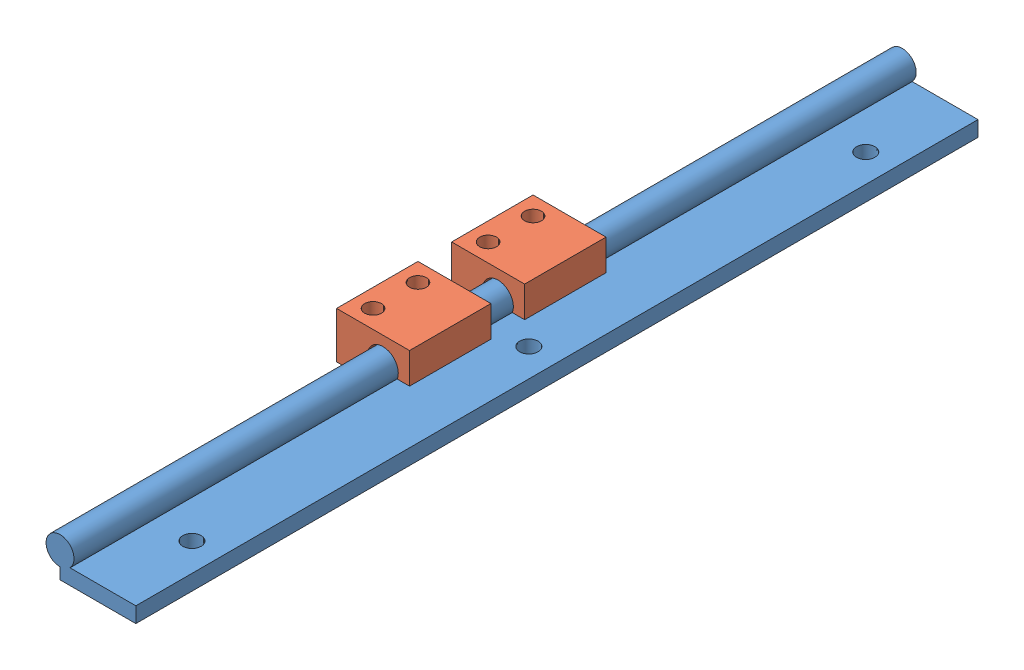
SolidWorks assembly X-Deslizadera con patin.SLDASM, configuration Predeterminado (file format 3800). Lengths in mm.
Overall size (43.5 18 300).
3 component instances, 2 part files, 0 mates.
Components (placement in the parent):
- X-Deslizadera simple-1: X-Deslizadera simple.SLDPRT [Predeterminado] at (0 22.75 10) size (32 14 300)
- X-Patin-1: X-Patin.SLDPRT [Predeterminado] at (-17 29.75 125) size (26 16.5 29)
- X-Patin-2: X-Patin.SLDPRT [Predeterminado] at (-17 29.75 166) size (26 16.5 29)
